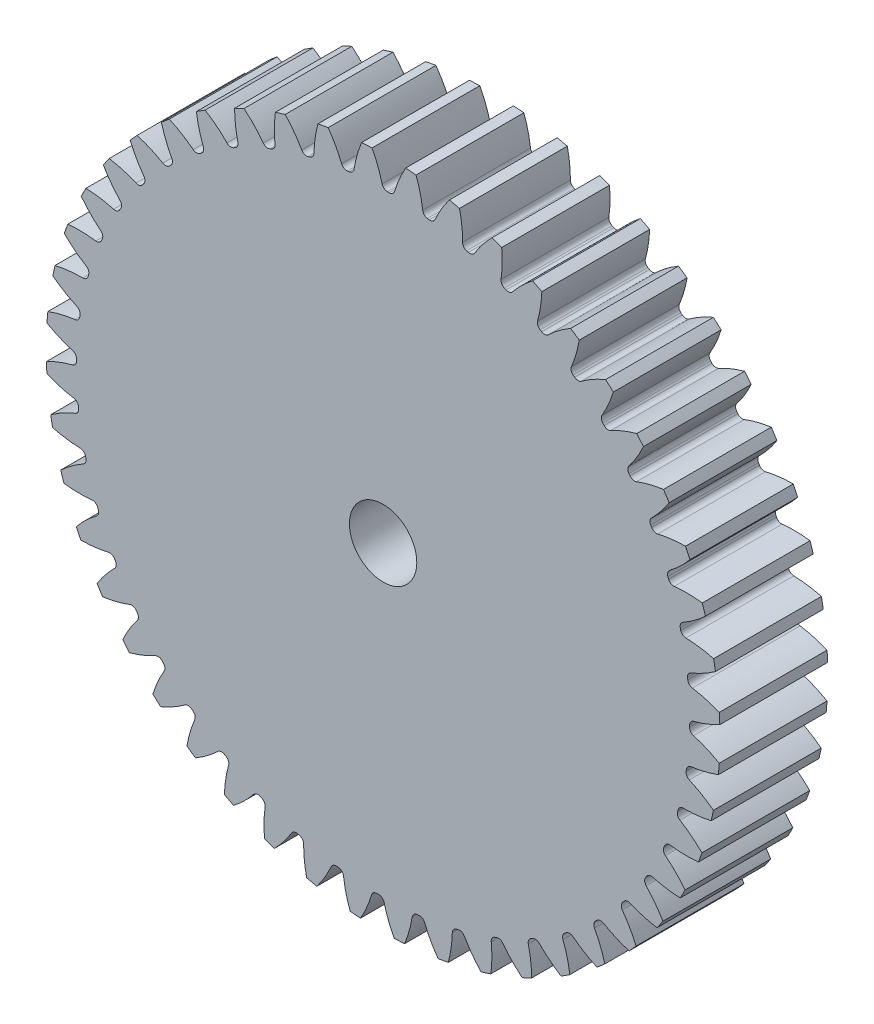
from build123d import *

# Parameters (mm, degrees)
SKETCH3_R         = 317.5
GEARBODY_DEPTH    = 101.6
TOOTHCUT_DEPTH    = 461.364051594
CIRPATTERN1_COUNT = 48
BOREDIA_R         = 31.75
BORE_DEPTH        = 12700


with BuildPart() as part:
    # Sketch3 → gearBody (new body)
    with BuildSketch(Plane.XY):
        Circle(SKETCH3_R)
    extrude(amount=GEARBODY_DEPTH)

    # Sketch2 → toothCut (cut, through all)
    with BuildSketch(Plane.XY):
        with BuildLine():
            ThreePointArc((288.86637634, -5.819986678), (288.883077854, -4.921682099), (288.896985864, -4.023329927))
            ThreePointArc((288.896985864, -4.023329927), (289.999945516, -0.90317185), (292.769388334, 0.908482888))
            ThreePointArc((292.769388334, 0.908482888), (305.420766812, 4.998411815), (317.5, 10.555121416))
            ThreePointArc((317.5, 10.555121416), (317.629307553, -5.411429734), (316.956190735, -21.364310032))
            ThreePointArc((316.956190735, -21.364310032), (305.073251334, -15.399358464), (292.568534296, -10.880846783))
            ThreePointArc((292.568534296, -10.880846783), (289.862410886, -8.975905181), (288.86637634, -5.819986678))
        make_face()
    toothcut = extrude(amount=TOOTHCUT_DEPTH, mode=Mode.SUBTRACT)

    # CirPattern1: toothCut ×48 about axis
    cirpattern1_axis = Axis((0, 0, 0), (0, 0, 1))
    for i in range(1, CIRPATTERN1_COUNT):
        add(toothcut.rotate(cirpattern1_axis, i * 360 / CIRPATTERN1_COUNT), mode=Mode.SUBTRACT)

    # boreDia → bore (cut, symmetric)
    with BuildSketch(Plane.XY):
        Circle(BOREDIA_R)
    extrude(amount=BORE_DEPTH, both=True, mode=Mode.SUBTRACT)


solid = part.part
